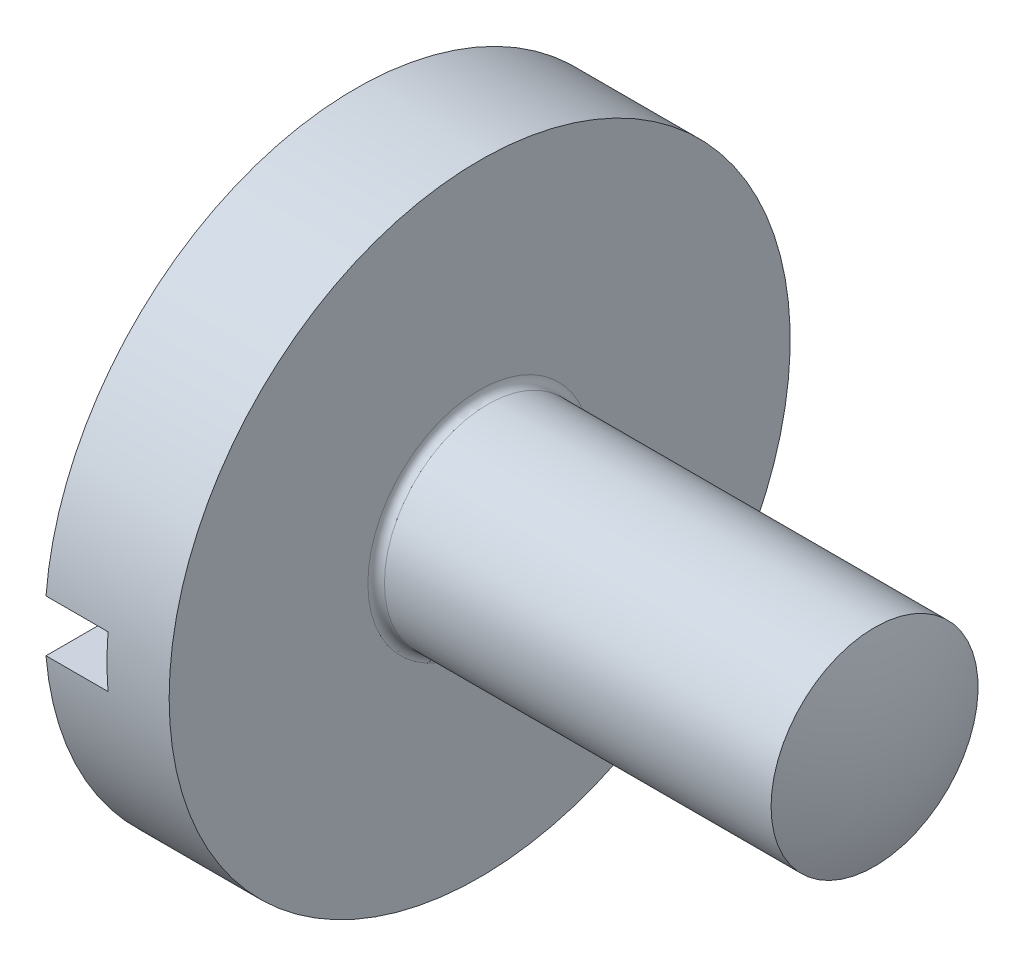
from build123d import *

# Parameters (mm, degrees)
SLOT_DEPTH      = 34.555923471
SLOT_DEPTH_BACK = 34.555923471
SKETCH2_W       = 3
SKETCH2_H       = 2.5


with BuildPart() as part:
    # Sketch1 → Base (revolve)
    with BuildSketch(Plane.XY, mode=Mode.PRIVATE) as base_sk:
        with BuildLine():
            Line((0, 0), (0, 15))
            Line((0, 15), (6, 15))
            Line((6, 15), (6, 5.4))
            ThreePointArc((6, 5.4), (6.117157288, 5.117157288), (6.4, 5))
            Line((6.4, 5), (25.076696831, 5))
            ThreePointArc((25.076696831, 5), (25.767239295, 2.542267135), (26, 0))
            Line((26, 0), (0, 0))
        make_face()
    revolve(base_sk.sketch.rotate(Axis((-64.356179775, 0, 0), (1, 0, 0)), 90), axis=Axis((-64.356179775, 0, 0), (1, 0, 0)))

    # Sketch2 → Slot (cut, two sides: drawn at the far end of the back side and taken through both)
    with BuildSketch(Plane.XY.offset(-SLOT_DEPTH_BACK)):
        with Locations((1.5, 0)):
            Rectangle(SKETCH2_W, SKETCH2_H)
    extrude(amount=SLOT_DEPTH + SLOT_DEPTH_BACK, mode=Mode.SUBTRACT)


solid = part.part
